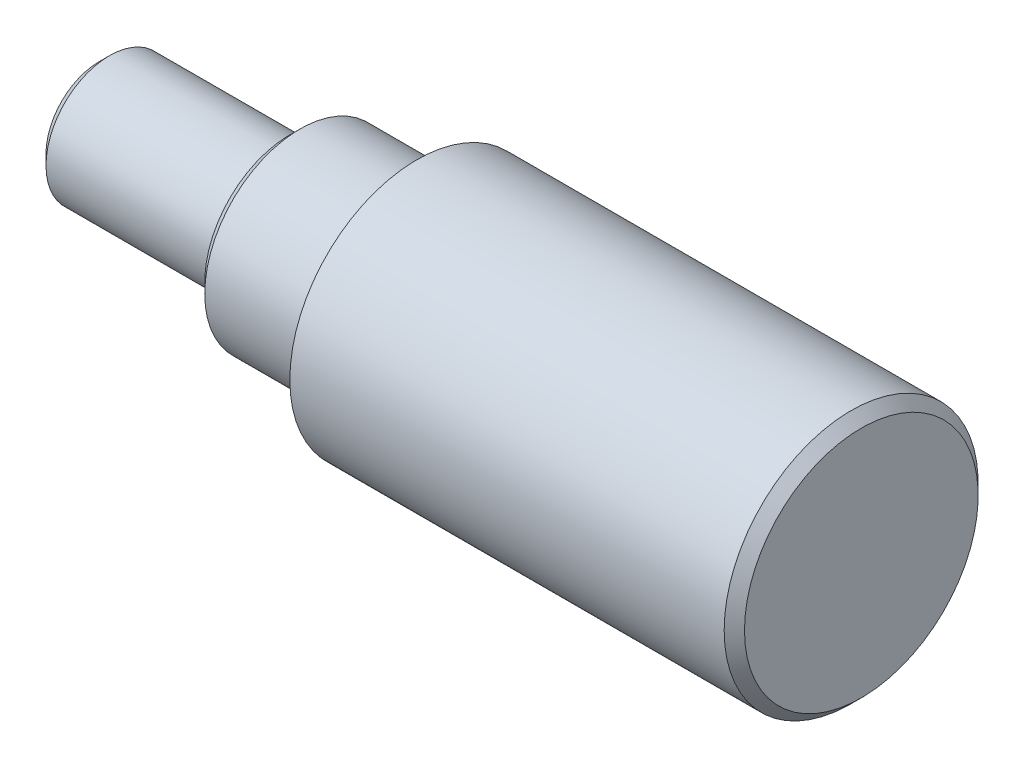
from build123d import *

# Parameters (mm, degrees)
CHAMFER1_SIZE = 0.508


with BuildPart() as part:
    # Sketch1 → Revolve1 (revolve)
    with BuildSketch(Plane.XY, mode=Mode.PRIVATE) as revolve1_sk:
        Polygon((0, 0), (0, 3.175), (9.525, 3.175), (9.525, 4.7625), (15.875, 4.7625), (15.875, 6.35), (38.1, 6.35), (38.1, 0), align=None)
    revolve(revolve1_sk.sketch.rotate(Axis((0, 0, 0), (1, 0, 0)), 90), axis=Axis((0, 0, 0), (1, 0, 0)))

    # Chamfer1
    chamfer1_edges = [part.edges().sort_by_distance(p)[0] for p in [
        (38.1, 0, -6.35),
        (9.525, 0, -4.7625),
        (0, 0, -3.175),
    ]]
    chamfer(chamfer1_edges, length=CHAMFER1_SIZE)


solid = part.part
